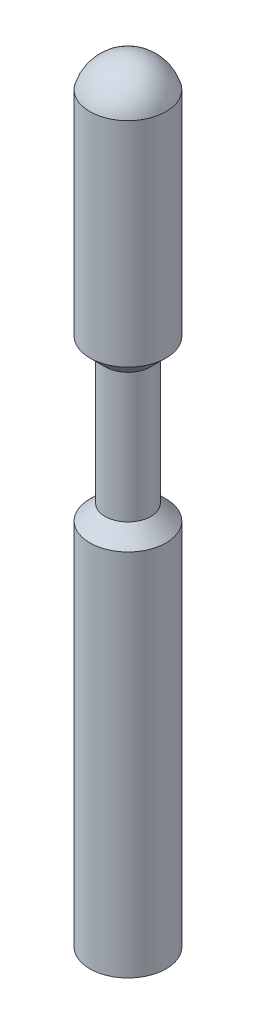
ISO-10303-21;
HEADER;
FILE_DESCRIPTION(('STEP AP214'),'2;1');
FILE_NAME('part.step','',(''),(''),'','','');
FILE_SCHEMA(('AUTOMOTIVE_DESIGN { 1 0 10303 214 1 1 1 1 }'));
ENDSEC;
DATA;
#1=APPLICATION_CONTEXT('core data for automotive mechanical design processes');
#2=APPLICATION_PROTOCOL_DEFINITION('international standard','automotive_design',2000,#1);
#3=PRODUCT_CONTEXT('',#1,'mechanical');
#4=PRODUCT('Part','Part','',(#3));
#5=PRODUCT_RELATED_PRODUCT_CATEGORY('part','',(#4));
#6=PRODUCT_DEFINITION_FORMATION('','',#4);
#7=PRODUCT_DEFINITION_CONTEXT('part definition',#1,'design');
#8=PRODUCT_DEFINITION('design','',#6,#7);
#9=PRODUCT_DEFINITION_SHAPE('','',#8);
#10=(LENGTH_UNIT() NAMED_UNIT(*) SI_UNIT(.MILLI.,.METRE.));
#11=(NAMED_UNIT(*) PLANE_ANGLE_UNIT() SI_UNIT($,.RADIAN.));
#12=(NAMED_UNIT(*) SI_UNIT($,.STERADIAN.) SOLID_ANGLE_UNIT());
#13=UNCERTAINTY_MEASURE_WITH_UNIT(LENGTH_MEASURE(1.E-05),#10,'distance_accuracy_value','');
#14=(GEOMETRIC_REPRESENTATION_CONTEXT(3) GLOBAL_UNCERTAINTY_ASSIGNED_CONTEXT((#13)) GLOBAL_UNIT_ASSIGNED_CONTEXT((#10,
#11,#12)) REPRESENTATION_CONTEXT('',''));
#15=CARTESIAN_POINT('',(0.,0.,0.));
#16=DIRECTION('',(0.,0.,1.));
#17=DIRECTION('',(1.,0.,0.));
#18=AXIS2_PLACEMENT_3D('',#15,#16,#17);
#19=CARTESIAN_POINT('',(2.50000000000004,0.,0.));
#20=DIRECTION('',(0.,1.,0.));
#21=DIRECTION('',(0.,0.,1.));
#22=AXIS2_PLACEMENT_3D('',#19,#20,#21);
#23=PLANE('',#22);
#24=CARTESIAN_POINT('',(0.,0.,0.));
#25=DIRECTION('',(0.,1.,0.));
#26=DIRECTION('',(0.,0.,1.));
#27=AXIS2_PLACEMENT_3D('',#24,#25,#26);
#28=CIRCLE('',#27,2.50000000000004);
#29=CARTESIAN_POINT('',(0.,0.,2.50000000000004));
#30=VERTEX_POINT('',#29);
#31=EDGE_CURVE('E367',#30,#30,#28,.T.);
#32=ORIENTED_EDGE('',*,*,#31,.F.);
#33=EDGE_LOOP('',(#32));
#34=FACE_BOUND('',#33,.T.);
#35=ADVANCED_FACE('F356',(#34),#23,.F.);
#36=CARTESIAN_POINT('',(0.,100.,0.));
#37=DIRECTION('',(0.,1.,0.));
#38=DIRECTION('',(0.,0.,1.));
#39=AXIS2_PLACEMENT_3D('',#36,#37,#38);
#40=CYLINDRICAL_SURFACE('',#39,2.50000000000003);
#41=CARTESIAN_POINT('',(0.,24.2,0.));
#42=DIRECTION('',(0.,1.,0.));
#43=DIRECTION('',(0.,0.,1.));
#44=AXIS2_PLACEMENT_3D('',#41,#42,#43);
#45=CIRCLE('',#44,2.50000000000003);
#46=CARTESIAN_POINT('',(0.,24.2,2.49999999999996));
#47=VERTEX_POINT('',#46);
#48=EDGE_CURVE('E371',#47,#47,#45,.T.);
#49=ORIENTED_EDGE('',*,*,#48,.F.);
#50=EDGE_LOOP('',(#49));
#51=FACE_BOUND('',#50,.T.);
#52=ORIENTED_EDGE('',*,*,#31,.T.);
#53=EDGE_LOOP('',(#52));
#54=FACE_BOUND('',#53,.T.);
#55=ADVANCED_FACE('F403',(#51,#54),#40,.T.);
#56=CARTESIAN_POINT('',(0.,100.,0.));
#57=DIRECTION('',(0.,1.,0.));
#58=DIRECTION('',(0.,0.,1.));
#59=AXIS2_PLACEMENT_3D('',#56,#57,#58);
#60=CYLINDRICAL_SURFACE('',#59,1.50000000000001);
#61=CARTESIAN_POINT('',(0.,33.7,0.));
#62=DIRECTION('',(0.,1.,0.));
#63=DIRECTION('',(0.,0.,1.));
#64=AXIS2_PLACEMENT_3D('',#61,#62,#63);
#65=CIRCLE('',#64,1.50000000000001);
#66=CARTESIAN_POINT('',(0.,33.7,1.49999999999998));
#67=VERTEX_POINT('',#66);
#68=EDGE_CURVE('E12',#67,#67,#65,.F.);
#69=ORIENTED_EDGE('',*,*,#68,.T.);
#70=EDGE_LOOP('',(#69));
#71=FACE_BOUND('',#70,.T.);
#72=CARTESIAN_POINT('',(0.,25.2,0.));
#73=DIRECTION('',(0.,-1.,0.));
#74=DIRECTION('',(0.,0.,-1.));
#75=AXIS2_PLACEMENT_3D('',#72,#73,#74);
#76=CIRCLE('',#75,1.50000000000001);
#77=CARTESIAN_POINT('',(0.,25.2,-1.50000000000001));
#78=VERTEX_POINT('',#77);
#79=EDGE_CURVE('E363',#78,#78,#76,.F.);
#80=ORIENTED_EDGE('',*,*,#79,.T.);
#81=EDGE_LOOP('',(#80));
#82=FACE_BOUND('',#81,.T.);
#83=ADVANCED_FACE('F387',(#71,#82),#60,.T.);
#84=CARTESIAN_POINT('',(0.,100.,0.));
#85=DIRECTION('',(0.,1.,0.));
#86=DIRECTION('',(0.,0.,1.));
#87=AXIS2_PLACEMENT_3D('',#84,#85,#86);
#88=CYLINDRICAL_SURFACE('',#87,2.50000000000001);
#89=CARTESIAN_POINT('',(0.,48.7,0.));
#90=DIRECTION('',(0.,1.,0.));
#91=DIRECTION('',(0.,0.,1.));
#92=AXIS2_PLACEMENT_3D('',#89,#90,#91);
#93=CIRCLE('',#92,2.50000000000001);
#94=CARTESIAN_POINT('',(0.,48.7,2.50000000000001));
#95=VERTEX_POINT('',#94);
#96=EDGE_CURVE('E379',#95,#95,#93,.T.);
#97=ORIENTED_EDGE('',*,*,#96,.F.);
#98=EDGE_LOOP('',(#97));
#99=FACE_BOUND('',#98,.T.);
#100=CARTESIAN_POINT('',(0.,34.7,0.));
#101=DIRECTION('',(0.,1.,0.));
#102=DIRECTION('',(0.,0.,1.));
#103=AXIS2_PLACEMENT_3D('',#100,#101,#102);
#104=CIRCLE('',#103,2.50000000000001);
#105=CARTESIAN_POINT('',(0.,34.7,2.49999999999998));
#106=VERTEX_POINT('',#105);
#107=EDGE_CURVE('E376',#106,#106,#104,.T.);
#108=ORIENTED_EDGE('',*,*,#107,.T.);
#109=EDGE_LOOP('',(#108));
#110=FACE_BOUND('',#109,.T.);
#111=ADVANCED_FACE('F384',(#99,#110),#88,.T.);
#112=CARTESIAN_POINT('',(0.,48.0052631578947,0.));
#113=DIRECTION('',(0.,0.,1.));
#114=DIRECTION('',(1.,0.,0.));
#115=AXIS2_PLACEMENT_3D('',#112,#113,#114);
#116=SPHERICAL_SURFACE('',#115,2.59473684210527);
#117=CARTESIAN_POINT('',(0.,48.0052631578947,0.));
#118=DIRECTION('',(0.,1.,0.));
#119=DIRECTION('',(0.,0.,1.));
#120=AXIS2_PLACEMENT_3D('',#117,#118,#119);
#121=SPHERICAL_SURFACE('',#120,2.59473684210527);
#122=ORIENTED_EDGE('',*,*,#96,.T.);
#123=EDGE_LOOP('',(#122));
#124=FACE_BOUND('',#123,.T.);
#125=ADVANCED_FACE('F358',(#124),#121,.T.);
#126=CARTESIAN_POINT('',(0.,34.7,0.));
#127=DIRECTION('',(0.,1.,0.));
#128=DIRECTION('',(0.,0.,1.));
#129=AXIS2_PLACEMENT_3D('',#126,#127,#128);
#130=CONICAL_SURFACE('',#129,2.50000000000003,0.78539816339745);
#131=ORIENTED_EDGE('',*,*,#68,.F.);
#132=EDGE_LOOP('',(#131));
#133=FACE_BOUND('',#132,.T.);
#134=ORIENTED_EDGE('',*,*,#107,.F.);
#135=EDGE_LOOP('',(#134));
#136=FACE_BOUND('',#135,.T.);
#137=ADVANCED_FACE('F391',(#133,#136),#130,.T.);
#138=CARTESIAN_POINT('',(0.,25.2,0.));
#139=DIRECTION('',(0.,-1.,0.));
#140=DIRECTION('',(0.,0.,-1.));
#141=AXIS2_PLACEMENT_3D('',#138,#139,#140);
#142=CONICAL_SURFACE('',#141,1.50000000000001,0.785398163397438);
#143=ORIENTED_EDGE('',*,*,#48,.T.);
#144=EDGE_LOOP('',(#143));
#145=FACE_BOUND('',#144,.T.);
#146=ORIENTED_EDGE('',*,*,#79,.F.);
#147=EDGE_LOOP('',(#146));
#148=FACE_BOUND('',#147,.T.);
#149=ADVANCED_FACE('F393',(#145,#148),#142,.T.);
#150=CLOSED_SHELL('',(#35,#55,#83,#111,#125,#137,#149));
#151=MANIFOLD_SOLID_BREP('B2',#150);
#152=ADVANCED_BREP_SHAPE_REPRESENTATION('',(#18,#151),#14);
#153=SHAPE_DEFINITION_REPRESENTATION(#9,#152);
ENDSEC;
END-ISO-10303-21;
